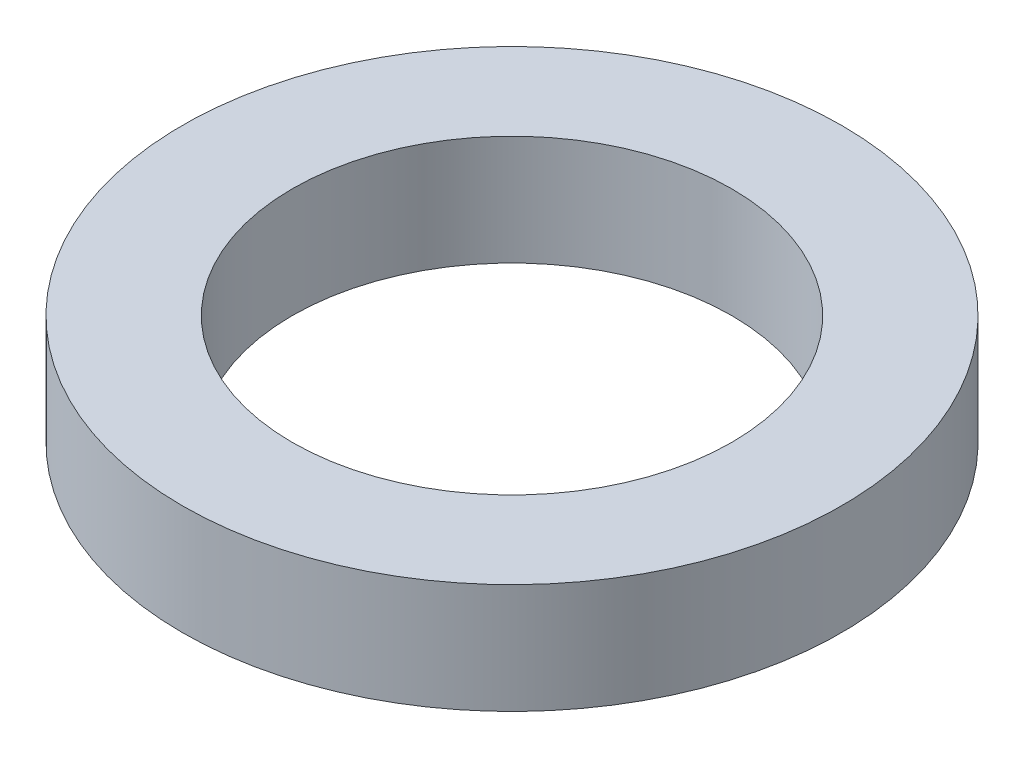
from build123d import *

# Parameters (mm, degrees)
SKETCH_1_R      = 6
SKETCH_1_R_2    = 4
EXTRUDE_1_DEPTH = 2


with BuildPart() as part:
    # Sketch 1 → Extrude 1 (new body)
    with BuildSketch(Plane(origin=(0, 0, 0), x_dir=(1, 0, 0), z_dir=(0, 1, 0))):
        with Locations(Location((0, 0, 0), (0, 0, 270))):
            Circle(SKETCH_1_R)
        with Locations(Location((0, 0, 0), (0, 0, 270))):
            Circle(SKETCH_1_R_2, mode=Mode.SUBTRACT)
    extrude(amount=EXTRUDE_1_DEPTH)


solid = part.part
